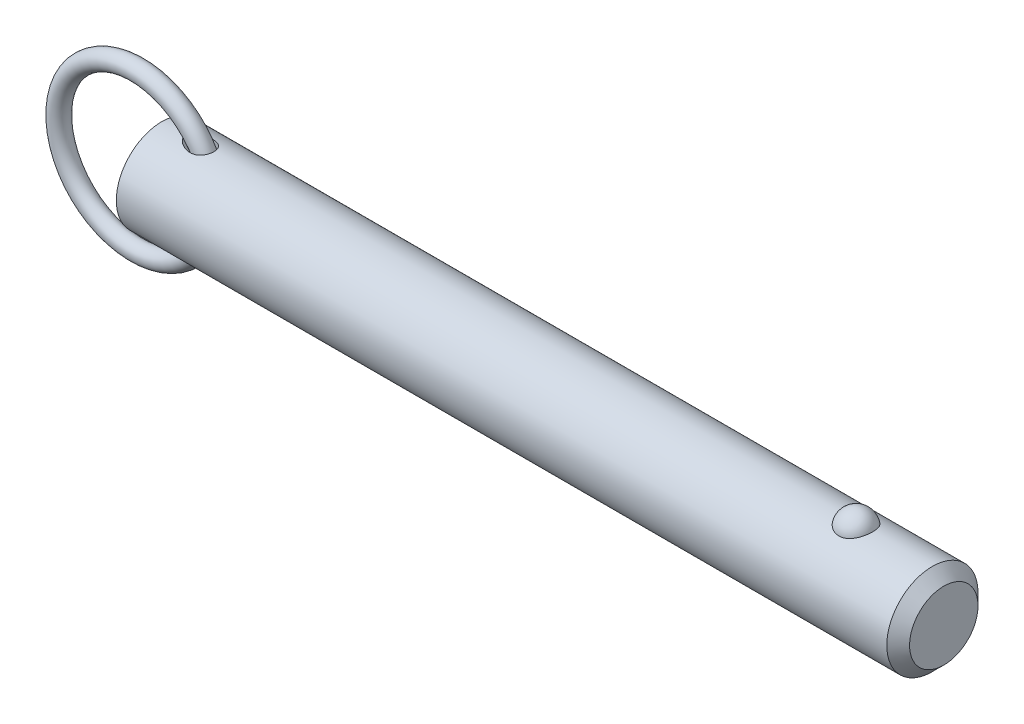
ISO-10303-21;
HEADER;
FILE_DESCRIPTION(('STEP AP214'),'2;1');
FILE_NAME('part.step','',(''),(''),'','','');
FILE_SCHEMA(('AUTOMOTIVE_DESIGN { 1 0 10303 214 1 1 1 1 }'));
ENDSEC;
DATA;
#1=APPLICATION_CONTEXT('core data for automotive mechanical design processes');
#2=APPLICATION_PROTOCOL_DEFINITION('international standard','automotive_design',2000,#1);
#3=PRODUCT_CONTEXT('',#1,'mechanical');
#4=PRODUCT('Part','Part','',(#3));
#5=PRODUCT_RELATED_PRODUCT_CATEGORY('part','',(#4));
#6=PRODUCT_DEFINITION_FORMATION('','',#4);
#7=PRODUCT_DEFINITION_CONTEXT('part definition',#1,'design');
#8=PRODUCT_DEFINITION('design','',#6,#7);
#9=PRODUCT_DEFINITION_SHAPE('','',#8);
#10=(LENGTH_UNIT() NAMED_UNIT(*) SI_UNIT(.MILLI.,.METRE.));
#11=(NAMED_UNIT(*) PLANE_ANGLE_UNIT() SI_UNIT($,.RADIAN.));
#12=(NAMED_UNIT(*) SI_UNIT($,.STERADIAN.) SOLID_ANGLE_UNIT());
#13=UNCERTAINTY_MEASURE_WITH_UNIT(LENGTH_MEASURE(1.E-05),#10,'distance_accuracy_value','');
#14=(GEOMETRIC_REPRESENTATION_CONTEXT(3) GLOBAL_UNCERTAINTY_ASSIGNED_CONTEXT((#13)) GLOBAL_UNIT_ASSIGNED_CONTEXT((#10,
#11,#12)) REPRESENTATION_CONTEXT('',''));
#15=CARTESIAN_POINT('',(0.,0.,0.));
#16=DIRECTION('',(0.,0.,1.));
#17=DIRECTION('',(1.,0.,0.));
#18=AXIS2_PLACEMENT_3D('',#15,#16,#17);
#19=CARTESIAN_POINT('',(-6.08699288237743,0.,0.));
#20=DIRECTION('',(0.,0.,1.));
#21=DIRECTION('',(1.,0.,0.));
#22=AXIS2_PLACEMENT_3D('',#19,#20,#21);
#23=TOROIDAL_SURFACE('',#22,19.05,2.223);
#24=CARTESIAN_POINT('',(15.1860071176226,0.,0.));
#25=VERTEX_POINT('',#24);
#26=VERTEX_LOOP('',#25);
#27=FACE_BOUND('',#26,.T.);
#28=ADVANCED_FACE('P0_F12',(#27),#23,.T.);
#29=CLOSED_SHELL('',(#28));
#30=MANIFOLD_SOLID_BREP('P0_B1',#29);
#31=CARTESIAN_POINT('',(0.,0.,0.));
#32=DIRECTION('',(1.,0.,0.));
#33=DIRECTION('',(0.,0.,-1.));
#34=AXIS2_PLACEMENT_3D('',#31,#32,#33);
#35=CYLINDRICAL_SURFACE('',#34,11.115);
#36=CARTESIAN_POINT('',(6.41405181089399,11.0227946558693,-1.4287136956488));
#37=CARTESIAN_POINT('',(6.49338916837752,11.0115377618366,-1.51556642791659));
#38=CARTESIAN_POINT('',(6.57765461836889,10.9998263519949,-1.59789397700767));
#39=CARTESIAN_POINT('',(6.75386647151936,10.9760304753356,-1.75391400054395));
#40=CARTESIAN_POINT('',(6.84582247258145,10.9639455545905,-1.82759540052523));
#41=CARTESIAN_POINT('',(7.03627827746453,10.9397989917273,-1.96698954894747));
#42=CARTESIAN_POINT('',(7.1348083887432,10.9277377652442,-2.03266078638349));
#43=CARTESIAN_POINT('',(7.33681032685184,10.9041015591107,-2.1558582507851));
#44=CARTESIAN_POINT('',(7.44028007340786,10.8925263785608,-2.21338786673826));
#45=CARTESIAN_POINT('',(7.64386117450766,10.8710104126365,-2.31666528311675));
#46=CARTESIAN_POINT('',(7.74368989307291,10.8610119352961,-2.36295942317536));
#47=CARTESIAN_POINT('',(7.94637195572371,10.8420168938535,-2.44863486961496));
#48=CARTESIAN_POINT('',(8.0492261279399,10.8330206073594,-2.48801426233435));
#49=CARTESIAN_POINT('',(8.36115573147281,10.807980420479,-2.59542730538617));
#50=CARTESIAN_POINT('',(8.57411849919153,10.7938278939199,-2.65299817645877));
#51=CARTESIAN_POINT('',(9.00825016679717,10.7725818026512,-2.73800108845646));
#52=CARTESIAN_POINT('',(9.22947335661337,10.7655491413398,-2.76517330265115));
#53=CARTESIAN_POINT('',(9.6736814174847,10.7605872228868,-2.78445308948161));
#54=CARTESIAN_POINT('',(9.89666486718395,10.7626512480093,-2.77658653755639));
#55=CARTESIAN_POINT('',(10.2950172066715,10.7754452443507,-2.72644436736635));
#56=CARTESIAN_POINT('',(10.4712789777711,10.7844280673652,-2.69109376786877));
#57=CARTESIAN_POINT('',(10.7292776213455,10.8024982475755,-2.61722365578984));
#58=CARTESIAN_POINT('',(10.8142337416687,10.8092901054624,-2.58911576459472));
#59=CARTESIAN_POINT('',(10.9813218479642,10.8242580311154,-2.52581287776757));
#60=CARTESIAN_POINT('',(11.0634550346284,10.8324335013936,-2.49062094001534));
#61=CARTESIAN_POINT('',(11.2247418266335,10.8500287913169,-2.41281958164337));
#62=CARTESIAN_POINT('',(11.3038694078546,10.8594572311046,-2.37015806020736));
#63=CARTESIAN_POINT('',(11.4576781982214,10.8792243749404,-2.27770403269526));
#64=CARTESIAN_POINT('',(11.5323615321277,10.8895626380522,-2.22791497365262));
#65=CARTESIAN_POINT('',(11.6765388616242,10.9108113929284,-2.12140590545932));
#66=CARTESIAN_POINT('',(11.7460329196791,10.9217218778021,-2.064685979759));
#67=CARTESIAN_POINT('',(11.8790597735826,10.9437207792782,-1.94471764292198));
#68=CARTESIAN_POINT('',(11.9425932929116,10.9548091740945,-1.88147002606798));
#69=CARTESIAN_POINT('',(12.109388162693,10.9851999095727,-1.69784918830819));
#70=CARTESIAN_POINT('',(12.205655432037,11.0042655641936,-1.57093023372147));
#71=CARTESIAN_POINT('',(12.374151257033,11.0393391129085,-1.3017676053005));
#72=CARTESIAN_POINT('',(12.4463875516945,11.0553479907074,-1.15952888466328));
#73=CARTESIAN_POINT('',(12.5615818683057,11.0816338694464,-0.871972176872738));
#74=CARTESIAN_POINT('',(12.6058896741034,11.0921698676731,-0.727217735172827));
#75=CARTESIAN_POINT('',(12.6699315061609,11.1075802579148,-0.43208997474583));
#76=CARTESIAN_POINT('',(12.6896681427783,11.1124552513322,-0.281717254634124));
#77=CARTESIAN_POINT('',(12.704022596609,11.1159901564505,0.0188164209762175));
#78=CARTESIAN_POINT('',(12.6988836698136,11.1147102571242,0.16896512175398));
#79=CARTESIAN_POINT('',(12.6641681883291,11.1062126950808,0.466238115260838));
#80=CARTESIAN_POINT('',(12.6345920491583,11.0989951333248,0.613362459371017));
#81=CARTESIAN_POINT('',(12.5517453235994,11.0794095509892,0.900330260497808));
#82=CARTESIAN_POINT('',(12.4984878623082,11.0670443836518,1.04017770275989));
#83=CARTESIAN_POINT('',(12.3696588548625,11.0385082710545,1.308745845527));
#84=CARTESIAN_POINT('',(12.2940887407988,11.0223375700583,1.43746725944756));
#85=CARTESIAN_POINT('',(12.122380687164,10.987872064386,1.68079704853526));
#86=CARTESIAN_POINT('',(12.0261637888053,10.969569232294,1.79534850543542));
#87=CARTESIAN_POINT('',(11.8161707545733,10.932836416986,2.00695695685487));
#88=CARTESIAN_POINT('',(11.7023941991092,10.9144064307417,2.10401353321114));
#89=CARTESIAN_POINT('',(11.4575656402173,10.8788057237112,2.28105326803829));
#90=CARTESIAN_POINT('',(11.3261451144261,10.8616794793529,2.36053412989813));
#91=CARTESIAN_POINT('',(11.0523589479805,10.8308019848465,2.49839044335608));
#92=CARTESIAN_POINT('',(10.9099908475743,10.8170514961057,2.55676113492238));
#93=CARTESIAN_POINT('',(10.6060622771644,10.7929728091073,2.65666105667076));
#94=CARTESIAN_POINT('',(10.4438877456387,10.7830209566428,2.69640163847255));
#95=CARTESIAN_POINT('',(10.1154037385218,10.7687230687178,2.75293129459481));
#96=CARTESIAN_POINT('',(9.94909141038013,10.7643810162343,2.76970406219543));
#97=CARTESIAN_POINT('',(9.54387061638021,10.7604809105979,2.7848723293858));
#98=CARTESIAN_POINT('',(9.30446860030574,10.7637793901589,2.7722775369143));
#99=CARTESIAN_POINT('',(8.94961255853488,10.7757341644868,2.72524141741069));
#100=CARTESIAN_POINT('',(8.83186896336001,10.7808994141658,2.70482239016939));
#101=CARTESIAN_POINT('',(8.59835142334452,10.7932548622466,2.65509992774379));
#102=CARTESIAN_POINT('',(8.48257728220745,10.8004448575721,2.62579738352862));
#103=CARTESIAN_POINT('',(8.25208469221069,10.8166382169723,2.55827624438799));
#104=CARTESIAN_POINT('',(8.13740214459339,10.8256649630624,2.51994155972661));
#105=CARTESIAN_POINT('',(7.91132058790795,10.8451170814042,2.43486475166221));
#106=CARTESIAN_POINT('',(7.79992154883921,10.8555424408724,2.38812270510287));
#107=CARTESIAN_POINT('',(7.58115677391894,10.8774251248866,2.28638483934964));
#108=CARTESIAN_POINT('',(7.47378802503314,10.8888816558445,2.23139534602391));
#109=CARTESIAN_POINT('',(7.26385624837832,10.9124540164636,2.11310265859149));
#110=CARTESIAN_POINT('',(7.16129168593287,10.9245696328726,2.04980214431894));
#111=CARTESIAN_POINT('',(6.91882218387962,10.9543689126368,1.88540538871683));
#112=CARTESIAN_POINT('',(6.7819377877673,10.9721958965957,1.77979827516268));
#113=CARTESIAN_POINT('',(6.52472441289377,11.0070222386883,1.5498969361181));
#114=CARTESIAN_POINT('',(6.40436902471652,11.0240228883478,1.42563320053));
#115=CARTESIAN_POINT('',(6.2183880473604,11.0509658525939,1.19529359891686));
#116=CARTESIAN_POINT('',(6.14691885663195,11.0615430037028,1.09404520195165));
#117=CARTESIAN_POINT('',(6.02043496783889,11.0805004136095,0.881508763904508));
#118=CARTESIAN_POINT('',(5.96539400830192,11.0888841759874,0.7702371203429));
#119=CARTESIAN_POINT('',(5.88475453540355,11.1012553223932,0.560577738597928));
#120=CARTESIAN_POINT('',(5.85559643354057,11.1057686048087,0.463603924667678));
#121=CARTESIAN_POINT('',(5.81381299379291,11.1122523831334,0.266083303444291));
#122=CARTESIAN_POINT('',(5.80117118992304,11.1142254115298,0.165540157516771));
#123=CARTESIAN_POINT('',(5.79363815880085,11.1153999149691,-0.0364747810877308));
#124=CARTESIAN_POINT('',(5.79878799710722,11.1145949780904,-0.137948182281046));
#125=CARTESIAN_POINT('',(5.82639592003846,11.1102987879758,-0.338493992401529));
#126=CARTESIAN_POINT('',(5.8488723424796,11.1068046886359,-0.437563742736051));
#127=CARTESIAN_POINT('',(5.91510741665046,11.0965857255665,-0.649968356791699));
#128=CARTESIAN_POINT('',(5.96220905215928,11.0893566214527,-0.762222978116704));
#129=CARTESIAN_POINT('',(6.07378449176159,11.072471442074,-0.977396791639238));
#130=CARTESIAN_POINT('',(6.13826787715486,11.0628140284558,-1.08031079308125));
#131=CARTESIAN_POINT('',(6.24101077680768,11.0477136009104,-1.2219580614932));
#132=CARTESIAN_POINT('',(6.27403486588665,11.042895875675,-1.26469183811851));
#133=CARTESIAN_POINT('',(6.3423802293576,11.0330152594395,-1.34817011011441));
#134=CARTESIAN_POINT('',(6.37769867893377,11.0279526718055,-1.38891694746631));
#135=CARTESIAN_POINT('',(6.41405181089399,11.0227946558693,-1.4287136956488));
#136=B_SPLINE_CURVE_WITH_KNOTS('',3,(#36,#37,#38,#39,#40,#41,#42,#43,#44,#45,#46,#47,#48,#49,
#50,#51,#52,#53,#54,#55,#56,#57,#58,#59,#60,#61,#62,#63,#64,#65,#66,#67,#68,#69,#70,#71,#72,#73,
#74,#75,#76,#77,#78,#79,#80,#81,#82,#83,#84,#85,#86,#87,#88,#89,#90,#91,#92,#93,#94,#95,#96,#97,
#98,#99,#100,#101,#102,#103,#104,#105,#106,#107,#108,#109,#110,#111,#112,#113,#114,#115,#116,
#117,#118,#119,#120,#121,#122,#123,#124,#125,#126,#127,#128,#129,#130,#131,#132,#133,#134,#135),
.UNSPECIFIED.,.T.,.F.,(4,2,2,2,2,2,2,2,2,2,2,2,2,2,2,2,2,2,2,2,2,2,2,2,2,2,2,2,2,2,2,2,2,2,2,2,
2,2,2,2,2,2,2,2,2,2,2,2,2,4),(0.,0.354433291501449,0.709315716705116,1.0659654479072,
1.42246628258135,1.7536715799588,2.08496839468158,2.74582009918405,3.41227815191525,
4.07824412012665,4.61583787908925,4.88478112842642,5.1536085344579,5.42439170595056,
5.69504436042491,5.96569375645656,6.23631025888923,6.7149072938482,7.1933500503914,
7.6464143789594,8.09943057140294,8.54802575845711,8.99661331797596,9.44495256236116,
9.89326303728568,10.3433195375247,10.7933867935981,11.2550086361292,11.7167345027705,
12.2165866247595,12.7167934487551,13.4318876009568,13.7904664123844,14.1490092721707,
14.5124394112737,14.8758662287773,15.239015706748,15.6020483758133,16.1219860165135,
16.6410830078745,17.0130520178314,17.3844231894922,17.6872330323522,17.9897407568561,
18.2929471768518,18.5964749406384,18.9603532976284,19.3244326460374,19.4870338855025,
19.649438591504),.UNSPECIFIED.);
#137=CARTESIAN_POINT('',(6.41405181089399,11.0227946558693,-1.4287136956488));
#138=VERTEX_POINT('',#137);
#139=EDGE_CURVE('P1_E40',#138,#138,#136,.T.);
#140=ORIENTED_EDGE('',*,*,#139,.T.);
#141=EDGE_LOOP('',(#140));
#142=FACE_BOUND('',#141,.T.);
#143=CARTESIAN_POINT('',(187.72125,0.,0.));
#144=DIRECTION('',(1.,0.,0.));
#145=DIRECTION('',(0.,0.,-1.));
#146=AXIS2_PLACEMENT_3D('',#143,#144,#145);
#147=CIRCLE('',#146,11.115);
#148=CARTESIAN_POINT('',(187.72125,0.,-11.115));
#149=VERTEX_POINT('',#148);
#150=EDGE_CURVE('P1_E25',#149,#149,#147,.T.);
#151=ORIENTED_EDGE('',*,*,#150,.F.);
#152=EDGE_LOOP('',(#151));
#153=FACE_BOUND('',#152,.T.);
#154=CARTESIAN_POINT('',(0.,0.,0.));
#155=DIRECTION('',(1.,0.,0.));
#156=DIRECTION('',(0.,0.,-1.));
#157=AXIS2_PLACEMENT_3D('',#154,#155,#156);
#158=CIRCLE('',#157,11.115);
#159=CARTESIAN_POINT('',(0.,0.,-11.115));
#160=VERTEX_POINT('',#159);
#161=EDGE_CURVE('P1_E9',#160,#160,#158,.T.);
#162=ORIENTED_EDGE('',*,*,#161,.T.);
#163=EDGE_LOOP('',(#162));
#164=FACE_BOUND('',#163,.T.);
#165=CARTESIAN_POINT('',(169.131068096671,10.3028087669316,4.17077409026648));
#166=CARTESIAN_POINT('',(168.914775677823,10.3028003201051,4.17078240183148));
#167=CARTESIAN_POINT('',(168.698548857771,10.3098895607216,4.15340593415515));
#168=CARTESIAN_POINT('',(168.272540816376,10.3373834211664,4.08449540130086));
#169=CARTESIAN_POINT('',(168.062757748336,10.3577841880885,4.03297121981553));
#170=CARTESIAN_POINT('',(167.655782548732,10.4095237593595,3.89746513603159));
#171=CARTESIAN_POINT('',(167.458572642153,10.4408466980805,3.81353029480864));
#172=CARTESIAN_POINT('',(167.081338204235,10.5110236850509,3.61560339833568));
#173=CARTESIAN_POINT('',(166.901317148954,10.5498792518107,3.50160528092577));
#174=CARTESIAN_POINT('',(166.557684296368,10.6322884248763,3.24292464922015));
#175=CARTESIAN_POINT('',(166.394686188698,10.6759443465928,3.09746040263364));
#176=CARTESIAN_POINT('',(166.094591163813,10.7625291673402,2.78171925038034));
#177=CARTESIAN_POINT('',(165.957499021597,10.805457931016,2.61143778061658));
#178=CARTESIAN_POINT('',(165.706408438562,10.8881935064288,2.24226695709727));
#179=CARTESIAN_POINT('',(165.593710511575,10.9277761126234,2.0424412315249));
#180=CARTESIAN_POINT('',(165.401777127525,10.997484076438,1.62578254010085));
#181=CARTESIAN_POINT('',(165.322544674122,11.0276085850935,1.40894804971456));
#182=CARTESIAN_POINT('',(165.198303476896,11.0756732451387,0.961250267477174));
#183=CARTESIAN_POINT('',(165.153760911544,11.0934470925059,0.730239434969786));
#184=CARTESIAN_POINT('',(165.101569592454,11.1143331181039,0.263439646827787));
#185=CARTESIAN_POINT('',(165.093920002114,11.1174456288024,0.0276507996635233));
#186=CARTESIAN_POINT('',(165.11561056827,11.1087161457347,-0.440729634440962));
#187=CARTESIAN_POINT('',(165.144762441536,11.0969502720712,-0.673331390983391));
#188=CARTESIAN_POINT('',(165.239143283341,11.0597872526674,-1.12996621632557));
#189=CARTESIAN_POINT('',(165.304372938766,11.0343898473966,-1.3539991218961));
#190=CARTESIAN_POINT('',(165.46969844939,10.972515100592,-1.78750286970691));
#191=CARTESIAN_POINT('',(165.56983863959,10.9360236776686,-1.99695478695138));
#192=CARTESIAN_POINT('',(165.802940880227,10.8557595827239,-2.3952066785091));
#193=CARTESIAN_POINT('',(165.935905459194,10.8119863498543,-2.5840050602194));
#194=CARTESIAN_POINT('',(166.232407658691,10.7216733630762,-2.93635726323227));
#195=CARTESIAN_POINT('',(166.396056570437,10.675123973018,-3.09981510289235));
#196=CARTESIAN_POINT('',(166.749860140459,10.5846571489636,-3.39592247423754));
#197=CARTESIAN_POINT('',(166.940012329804,10.5407394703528,-3.52857487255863));
#198=CARTESIAN_POINT('',(167.33750141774,10.4616690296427,-3.75646057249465));
#199=CARTESIAN_POINT('',(167.54436705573,10.4263443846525,-3.85245432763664));
#200=CARTESIAN_POINT('',(167.972954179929,10.3675574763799,-4.00798747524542));
#201=CARTESIAN_POINT('',(168.194670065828,10.3440907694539,-4.06754052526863));
#202=CARTESIAN_POINT('',(168.634669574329,10.3128282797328,-4.1461431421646));
#203=CARTESIAN_POINT('',(168.852565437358,10.3043040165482,-4.16707833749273));
#204=CARTESIAN_POINT('',(169.28894951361,10.3016771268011,-4.17357158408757));
#205=CARTESIAN_POINT('',(169.507437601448,10.3075716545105,-4.15913661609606));
#206=CARTESIAN_POINT('',(169.931744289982,10.3326686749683,-4.09636961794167));
#207=CARTESIAN_POINT('',(170.137745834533,10.3514555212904,-4.04909574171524));
#208=CARTESIAN_POINT('',(170.538576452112,10.3998183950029,-3.92320197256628));
#209=CARTESIAN_POINT('',(170.7334046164,10.4293952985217,-3.84457953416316));
#210=CARTESIAN_POINT('',(171.111191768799,10.4969600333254,-3.65612410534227));
#211=CARTESIAN_POINT('',(171.293797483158,10.5351178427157,-3.54564545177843));
#212=CARTESIAN_POINT('',(171.638204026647,10.6154999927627,-3.29718036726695));
#213=CARTESIAN_POINT('',(171.800000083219,10.657725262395,-3.15918764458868));
#214=CARTESIAN_POINT('',(172.106959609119,10.744212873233,-2.8516358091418));
#215=CARTESIAN_POINT('',(172.250891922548,10.7884718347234,-2.68084605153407));
#216=CARTESIAN_POINT('',(172.509237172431,10.872374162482,-2.31721864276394));
#217=CARTESIAN_POINT('',(172.623644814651,10.9120167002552,-2.12437704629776));
#218=CARTESIAN_POINT('',(172.823873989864,10.9838919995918,-1.71516999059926));
#219=CARTESIAN_POINT('',(172.90866178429,11.0158465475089,-1.49824866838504));
#220=CARTESIAN_POINT('',(173.04268382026,11.0673523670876,-1.05228572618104));
#221=CARTESIAN_POINT('',(173.091917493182,11.086903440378,-0.823243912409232));
#222=CARTESIAN_POINT('',(173.153891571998,11.1116323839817,-0.359087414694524));
#223=CARTESIAN_POINT('',(173.166566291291,11.1167843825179,-0.123962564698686));
#224=CARTESIAN_POINT('',(173.154973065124,11.1121144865,0.345220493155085));
#225=CARTESIAN_POINT('',(173.130705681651,11.1022928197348,0.579278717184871));
#226=CARTESIAN_POINT('',(173.045907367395,11.0687504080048,1.0386653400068));
#227=CARTESIAN_POINT('',(172.985529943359,11.0450885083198,1.26402641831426));
#228=CARTESIAN_POINT('',(172.829853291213,10.9863185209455,1.70076772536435));
#229=CARTESIAN_POINT('',(172.734551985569,10.9512097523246,1.91214712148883));
#230=CARTESIAN_POINT('',(172.510397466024,10.8729733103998,2.31608359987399));
#231=CARTESIAN_POINT('',(172.381380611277,10.8298068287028,2.50854240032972));
#232=CARTESIAN_POINT('',(172.092732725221,10.7401896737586,2.86808766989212));
#233=CARTESIAN_POINT('',(171.933102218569,10.6937390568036,3.03517457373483));
#234=CARTESIAN_POINT('',(171.587534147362,10.6029321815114,3.33857581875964));
#235=CARTESIAN_POINT('',(171.401708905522,10.5585680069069,3.47501541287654));
#236=CARTESIAN_POINT('',(171.007875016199,10.4769321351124,3.71390897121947));
#237=CARTESIAN_POINT('',(170.799863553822,10.439661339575,3.81635861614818));
#238=CARTESIAN_POINT('',(170.354066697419,10.3749407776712,3.9891063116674));
#239=CARTESIAN_POINT('',(170.115234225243,10.3482457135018,4.0570092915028));
#240=CARTESIAN_POINT('',(169.627925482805,10.312188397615,4.14782844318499));
#241=CARTESIAN_POINT('',(169.379453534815,10.3028184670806,4.17076454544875));
#242=CARTESIAN_POINT('',(169.131068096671,10.3028087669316,4.17077409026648));
#243=B_SPLINE_CURVE_WITH_KNOTS('',3,(#165,#166,#167,#168,#169,#170,#171,#172,#173,#174,#175,
#176,#177,#178,#179,#180,#181,#182,#183,#184,#185,#186,#187,#188,#189,#190,#191,#192,#193,#194,
#195,#196,#197,#198,#199,#200,#201,#202,#203,#204,#205,#206,#207,#208,#209,#210,#211,#212,#213,
#214,#215,#216,#217,#218,#219,#220,#221,#222,#223,#224,#225,#226,#227,#228,#229,#230,#231,#232,
#233,#234,#235,#236,#237,#238,#239,#240,#241,#242),.UNSPECIFIED.,.T.,.F.,(4,2,2,2,2,2,2,2,2,2,2,
2,2,2,2,2,2,2,2,2,2,2,2,2,2,2,2,2,2,2,2,2,2,2,2,2,2,2,4),(0.,0.64796614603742,1.29574482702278,
1.94258643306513,2.58955857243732,3.25496465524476,3.92049326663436,4.61566368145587,
5.3108964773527,6.0153182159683,6.71972398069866,7.42054043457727,8.12137023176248,
8.82309331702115,9.52487047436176,10.2292439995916,10.9335519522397,11.622333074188,
12.3108558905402,12.9647664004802,13.6185478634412,14.2521847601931,14.8858731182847,
15.5334360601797,16.1811472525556,16.8611459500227,17.5412664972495,18.2431855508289,
18.9451158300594,19.6483065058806,20.3514864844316,21.0516982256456,21.7519516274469,
22.4556690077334,23.1593743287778,23.8601491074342,24.5610129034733,25.3054529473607,
26.0495629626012),.UNSPECIFIED.);
#244=CARTESIAN_POINT('',(169.131068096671,10.3028087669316,4.17077409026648));
#245=VERTEX_POINT('',#244);
#246=EDGE_CURVE('P1_E34',#245,#245,#243,.T.);
#247=ORIENTED_EDGE('',*,*,#246,.T.);
#248=EDGE_LOOP('',(#247));
#249=FACE_BOUND('',#248,.T.);
#250=CARTESIAN_POINT('',(6.41405181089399,-11.0227946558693,-1.4287136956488));
#251=CARTESIAN_POINT('',(6.33124061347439,-11.0345445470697,-1.33806125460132));
#252=CARTESIAN_POINT('',(6.25372866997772,-11.0458090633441,-1.24240732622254));
#253=CARTESIAN_POINT('',(6.11277905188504,-11.0666115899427,-1.04095704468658));
#254=CARTESIAN_POINT('',(6.04933920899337,-11.0761498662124,-0.935162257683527));
#255=CARTESIAN_POINT('',(5.94029181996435,-11.0927063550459,-0.712476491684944));
#256=CARTESIAN_POINT('',(5.89492964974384,-11.0996897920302,-0.595457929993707));
#257=CARTESIAN_POINT('',(5.84498161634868,-11.1074141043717,-0.414997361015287));
#258=CARTESIAN_POINT('',(5.83135004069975,-11.1095300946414,-0.354047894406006));
#259=CARTESIAN_POINT('',(5.81051649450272,-11.1127688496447,-0.231041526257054));
#260=CARTESIAN_POINT('',(5.80331311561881,-11.1138918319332,-0.168984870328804));
#261=CARTESIAN_POINT('',(5.79296529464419,-11.1155042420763,-0.000484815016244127));
#262=CARTESIAN_POINT('',(5.79625267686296,-11.1149904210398,0.106437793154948));
#263=CARTESIAN_POINT('',(5.82213676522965,-11.1109609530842,0.317809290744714));
#264=CARTESIAN_POINT('',(5.84474662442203,-11.1074432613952,0.42225644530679));
#265=CARTESIAN_POINT('',(5.911131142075,-11.097197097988,0.639361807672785));
#266=CARTESIAN_POINT('',(5.95733120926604,-11.090102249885,0.751250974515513));
#267=CARTESIAN_POINT('',(6.06709542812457,-11.0734770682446,0.965912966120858));
#268=CARTESIAN_POINT('',(6.13068735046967,-11.06394284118,1.06867085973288));
#269=CARTESIAN_POINT('',(6.30294237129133,-11.0385920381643,1.30890635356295));
#270=CARTESIAN_POINT('',(6.41896200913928,-11.0218881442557,1.44097376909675));
#271=CARTESIAN_POINT('',(6.6698965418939,-10.9871512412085,1.68553954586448));
#272=CARTESIAN_POINT('',(6.80485520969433,-10.9691152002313,1.79799117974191));
#273=CARTESIAN_POINT('',(7.04881236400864,-10.9382283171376,1.97587596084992));
#274=CARTESIAN_POINT('',(7.15465712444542,-10.9253240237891,2.04570822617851));
#275=CARTESIAN_POINT('',(7.37202504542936,-10.9000987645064,2.17611840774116));
#276=CARTESIAN_POINT('',(7.48355057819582,-10.8877780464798,2.23669241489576));
#277=CARTESIAN_POINT('',(7.71132418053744,-10.8641580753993,2.34873831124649));
#278=CARTESIAN_POINT('',(7.82757727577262,-10.8528599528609,2.40020018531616));
#279=CARTESIAN_POINT('',(8.06386825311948,-10.8317234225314,2.49385169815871));
#280=CARTESIAN_POINT('',(8.18390558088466,-10.8218848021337,2.53604268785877));
#281=CARTESIAN_POINT('',(8.42918336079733,-10.8039208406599,2.61152283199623));
#282=CARTESIAN_POINT('',(8.55447802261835,-10.7958283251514,2.64464414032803));
#283=CARTESIAN_POINT('',(8.80752127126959,-10.781995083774,2.70048793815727));
#284=CARTESIAN_POINT('',(8.93527019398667,-10.7762546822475,2.72320899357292));
#285=CARTESIAN_POINT('',(9.1921017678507,-10.7675291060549,2.75750994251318));
#286=CARTESIAN_POINT('',(9.32118105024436,-10.7645381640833,2.76911315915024));
#287=CARTESIAN_POINT('',(9.57984338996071,-10.761622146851,2.78042035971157));
#288=CARTESIAN_POINT('',(9.70942621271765,-10.7616957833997,2.78012934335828));
#289=CARTESIAN_POINT('',(10.0243125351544,-10.7659059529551,2.76381534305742));
#290=CARTESIAN_POINT('',(10.209307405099,-10.7717977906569,2.74099674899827));
#291=CARTESIAN_POINT('',(10.5731188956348,-10.7905408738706,2.66626238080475));
#292=CARTESIAN_POINT('',(10.7519389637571,-10.8033881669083,2.61436313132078));
#293=CARTESIAN_POINT('',(11.0114289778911,-10.8271584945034,2.51336808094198));
#294=CARTESIAN_POINT('',(11.096831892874,-10.835881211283,2.47562331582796));
#295=CARTESIAN_POINT('',(11.2636000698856,-10.8545688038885,2.39236170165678));
#296=CARTESIAN_POINT('',(11.3449673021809,-10.8645330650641,2.3468486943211));
#297=CARTESIAN_POINT('',(11.5027832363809,-10.8853818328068,2.24815967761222));
#298=CARTESIAN_POINT('',(11.5792327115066,-10.8962661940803,2.19498487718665));
#299=CARTESIAN_POINT('',(11.7263315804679,-10.9185541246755,2.08128855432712));
#300=CARTESIAN_POINT('',(11.7969818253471,-10.9299576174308,2.02076811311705));
#301=CARTESIAN_POINT('',(11.9817953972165,-10.9613645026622,1.84513663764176));
#302=CARTESIAN_POINT('',(12.0893012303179,-10.9814643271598,1.72286660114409));
#303=CARTESIAN_POINT('',(12.2803576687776,-11.0193991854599,1.46066991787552));
#304=CARTESIAN_POINT('',(12.3639173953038,-11.0372350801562,1.3207500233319));
#305=CARTESIAN_POINT('',(12.4996220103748,-11.0672969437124,1.03778067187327));
#306=CARTESIAN_POINT('',(12.5535315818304,-11.0798242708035,0.895607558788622));
#307=CARTESIAN_POINT('',(12.636874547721,-11.0995427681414,0.603918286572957));
#308=CARTESIAN_POINT('',(12.6663115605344,-11.1067347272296,0.454403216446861));
#309=CARTESIAN_POINT('',(12.6997387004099,-11.1149224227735,0.154577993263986));
#310=CARTESIAN_POINT('',(12.7040886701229,-11.1160057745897,0.00431019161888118));
#311=CARTESIAN_POINT('',(12.6882048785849,-11.1120956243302,-0.294841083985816));
#312=CARTESIAN_POINT('',(12.6679715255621,-11.1071022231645,-0.443724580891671));
#313=CARTESIAN_POINT('',(12.6034470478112,-11.0915888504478,-0.735688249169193));
#314=CARTESIAN_POINT('',(12.5591858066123,-11.0810757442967,-0.878775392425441));
#315=CARTESIAN_POINT('',(12.4477416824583,-11.0556687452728,-1.15529525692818));
#316=CARTESIAN_POINT('',(12.3805601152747,-11.0407751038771,-1.28872853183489));
#317=CARTESIAN_POINT('',(12.2248919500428,-11.0081839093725,-1.54257976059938));
#318=CARTESIAN_POINT('',(12.1363549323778,-10.9904797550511,-1.66296592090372));
#319=CARTESIAN_POINT('',(11.9406137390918,-10.9541951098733,-1.88726577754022));
#320=CARTESIAN_POINT('',(11.833409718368,-10.9356146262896,-1.9911796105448));
#321=CARTESIAN_POINT('',(11.601318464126,-10.8991360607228,-2.18213646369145));
#322=CARTESIAN_POINT('',(11.4761325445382,-10.8812577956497,-2.26881927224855));
#323=CARTESIAN_POINT('',(11.2134852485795,-10.8482871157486,-2.42157282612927));
#324=CARTESIAN_POINT('',(11.0760218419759,-10.8331951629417,-2.48764015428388));
#325=CARTESIAN_POINT('',(10.7828968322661,-10.8061050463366,-2.60290068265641));
#326=CARTESIAN_POINT('',(10.6266338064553,-10.7943907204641,-2.65062248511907));
#327=CARTESIAN_POINT('',(10.3086617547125,-10.7762429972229,-2.72345054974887));
#328=CARTESIAN_POINT('',(10.146948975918,-10.7698133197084,-2.74854088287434));
#329=CARTESIAN_POINT('',(9.75541304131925,-10.7608036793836,-2.78368719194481));
#330=CARTESIAN_POINT('',(9.52459435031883,-10.7608467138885,-2.78350276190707));
#331=CARTESIAN_POINT('',(9.0660496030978,-10.7702674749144,-2.74677945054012));
#332=CARTESIAN_POINT('',(8.83832966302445,-10.7796615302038,-2.71017697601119));
#333=CARTESIAN_POINT('',(8.38783466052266,-10.8058248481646,-2.60392490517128));
#334=CARTESIAN_POINT('',(8.16517101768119,-10.8226939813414,-2.53382676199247));
#335=CARTESIAN_POINT('',(7.84087311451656,-10.8516548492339,-2.40555545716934));
#336=CARTESIAN_POINT('',(7.73435551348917,-10.8619221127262,-2.35892455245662));
#337=CARTESIAN_POINT('',(7.52510420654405,-10.883357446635,-2.25797017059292));
#338=CARTESIAN_POINT('',(7.42236986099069,-10.8945253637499,-2.20364800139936));
#339=CARTESIAN_POINT('',(7.23808758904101,-10.915528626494,-2.09688018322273));
#340=CARTESIAN_POINT('',(7.15584631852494,-10.9252787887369,-2.0456107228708));
#341=CARTESIAN_POINT('',(6.99510576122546,-10.944960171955,-1.93754729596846));
#342=CARTESIAN_POINT('',(6.91660574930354,-10.9548913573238,-1.88075440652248));
#343=CARTESIAN_POINT('',(6.76418133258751,-10.974690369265,-1.76154504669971));
#344=CARTESIAN_POINT('',(6.69024940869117,-10.9845582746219,-1.6991382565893));
#345=CARTESIAN_POINT('',(6.54780119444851,-11.0039826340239,-1.56842485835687));
#346=CARTESIAN_POINT('',(6.47928247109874,-11.0135392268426,-1.50012092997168));
#347=CARTESIAN_POINT('',(6.41405181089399,-11.0227946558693,-1.4287136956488));
#348=B_SPLINE_CURVE_WITH_KNOTS('',3,(#250,#251,#252,#253,#254,#255,#256,#257,#258,#259,#260,
#261,#262,#263,#264,#265,#266,#267,#268,#269,#270,#271,#272,#273,#274,#275,#276,#277,#278,#279,
#280,#281,#282,#283,#284,#285,#286,#287,#288,#289,#290,#291,#292,#293,#294,#295,#296,#297,#298,
#299,#300,#301,#302,#303,#304,#305,#306,#307,#308,#309,#310,#311,#312,#313,#314,#315,#316,#317,
#318,#319,#320,#321,#322,#323,#324,#325,#326,#327,#328,#329,#330,#331,#332,#333,#334,#335,#336,
#337,#338,#339,#340,#341,#342,#343,#344,#345,#346,#347),.UNSPECIFIED.,.T.,.F.,(4,2,2,2,2,2,2,2,
2,2,2,2,2,2,2,2,2,2,2,2,2,2,2,2,2,2,2,2,2,2,2,2,2,2,2,2,2,2,2,2,2,2,2,2,2,2,2,2,4),(0.,
0.369835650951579,0.739614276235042,1.11425380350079,1.30141910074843,1.48854338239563,
1.80745879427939,2.12659146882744,2.48838884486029,2.85076733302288,3.3776216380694,
3.9057143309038,4.287639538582,4.66972556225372,5.05222896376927,5.43467659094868,
5.82378546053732,6.21294796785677,6.6012922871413,6.98947336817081,7.54669558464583,
8.10360148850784,8.38458539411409,8.66543074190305,8.94623182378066,9.22699162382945,
9.71628887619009,10.2053995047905,10.6608871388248,11.1163074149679,11.5651786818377,
12.0140424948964,12.4623493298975,12.9106304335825,13.3599804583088,13.8093267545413,
14.2672570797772,14.7252632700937,15.214740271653,15.7045615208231,16.3932594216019,
17.083162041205,17.7825738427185,18.1325177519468,18.4824022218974,18.7744056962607,
19.0663523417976,19.3578048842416,19.6491256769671),.UNSPECIFIED.);
#349=CARTESIAN_POINT('',(6.41405181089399,-11.0227946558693,-1.4287136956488));
#350=VERTEX_POINT('',#349);
#351=EDGE_CURVE('P1_E17',#350,#350,#348,.T.);
#352=ORIENTED_EDGE('',*,*,#351,.T.);
#353=EDGE_LOOP('',(#352));
#354=FACE_BOUND('',#353,.T.);
#355=ADVANCED_FACE('P1_F13',(#142,#153,#164,#249,#354),#35,.T.);
#356=CARTESIAN_POINT('',(0.,0.,0.));
#357=DIRECTION('',(-1.,0.,0.));
#358=DIRECTION('',(0.,0.,1.));
#359=AXIS2_PLACEMENT_3D('',#356,#357,#358);
#360=PLANE('',#359);
#361=ORIENTED_EDGE('',*,*,#161,.F.);
#362=EDGE_LOOP('',(#361));
#363=FACE_BOUND('',#362,.T.);
#364=ADVANCED_FACE('P1_F15',(#363),#360,.T.);
#365=CARTESIAN_POINT('',(190.5,0.,0.));
#366=DIRECTION('',(-1.,0.,0.));
#367=DIRECTION('',(0.,0.,1.));
#368=AXIS2_PLACEMENT_3D('',#365,#366,#367);
#369=CONICAL_SURFACE('',#368,8.33625000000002,0.78539816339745);
#370=ORIENTED_EDGE('',*,*,#150,.T.);
#371=EDGE_LOOP('',(#370));
#372=FACE_BOUND('',#371,.T.);
#373=CARTESIAN_POINT('',(190.5,0.,0.));
#374=DIRECTION('',(1.,0.,0.));
#375=DIRECTION('',(0.,0.,-1.));
#376=AXIS2_PLACEMENT_3D('',#373,#374,#375);
#377=CIRCLE('',#376,8.33625000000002);
#378=CARTESIAN_POINT('',(190.5,0.,-8.33625000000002));
#379=VERTEX_POINT('',#378);
#380=EDGE_CURVE('P1_E30',#379,#379,#377,.T.);
#381=ORIENTED_EDGE('',*,*,#380,.F.);
#382=EDGE_LOOP('',(#381));
#383=FACE_BOUND('',#382,.T.);
#384=ADVANCED_FACE('P1_F55',(#372,#383),#369,.T.);
#385=CARTESIAN_POINT('',(190.5,8.33625000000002,0.));
#386=DIRECTION('',(1.,0.,0.));
#387=DIRECTION('',(0.,0.,-1.));
#388=AXIS2_PLACEMENT_3D('',#385,#386,#387);
#389=PLANE('',#388);
#390=ORIENTED_EDGE('',*,*,#380,.T.);
#391=EDGE_LOOP('',(#390));
#392=FACE_BOUND('',#391,.T.);
#393=ADVANCED_FACE('P1_F51',(#392),#389,.T.);
#394=CARTESIAN_POINT('',(169.131068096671,10.0035,0.));
#395=DIRECTION('',(-1.,0.,0.));
#396=DIRECTION('',(0.,1.,0.));
#397=AXIS2_PLACEMENT_3D('',#394,#395,#396);
#398=SPHERICAL_SURFACE('',#397,4.18150000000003);
#399=ORIENTED_EDGE('',*,*,#246,.F.);
#400=EDGE_LOOP('',(#399));
#401=FACE_BOUND('',#400,.T.);
#402=ADVANCED_FACE('P1_F46',(#401),#398,.T.);
#403=CARTESIAN_POINT('',(-6.08699288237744,0.,0.));
#404=DIRECTION('',(0.,0.,1.));
#405=DIRECTION('',(1.,0.,0.));
#406=AXIS2_PLACEMENT_3D('',#403,#404,#405);
#407=TOROIDAL_SURFACE('',#406,19.05,2.77875);
#408=ORIENTED_EDGE('',*,*,#351,.F.);
#409=EDGE_LOOP('',(#408));
#410=FACE_BOUND('',#409,.T.);
#411=ORIENTED_EDGE('',*,*,#139,.F.);
#412=EDGE_LOOP('',(#411));
#413=FACE_BOUND('',#412,.T.);
#414=ADVANCED_FACE('P1_F50',(#410,#413),#407,.F.);
#415=CLOSED_SHELL('',(#355,#364,#384,#393,#402,#414));
#416=MANIFOLD_SOLID_BREP('P1_B1',#415);
#417=ADVANCED_BREP_SHAPE_REPRESENTATION('',(#18,#30,#416),#14);
#418=SHAPE_DEFINITION_REPRESENTATION(#9,#417);
ENDSEC;
END-ISO-10303-21;
